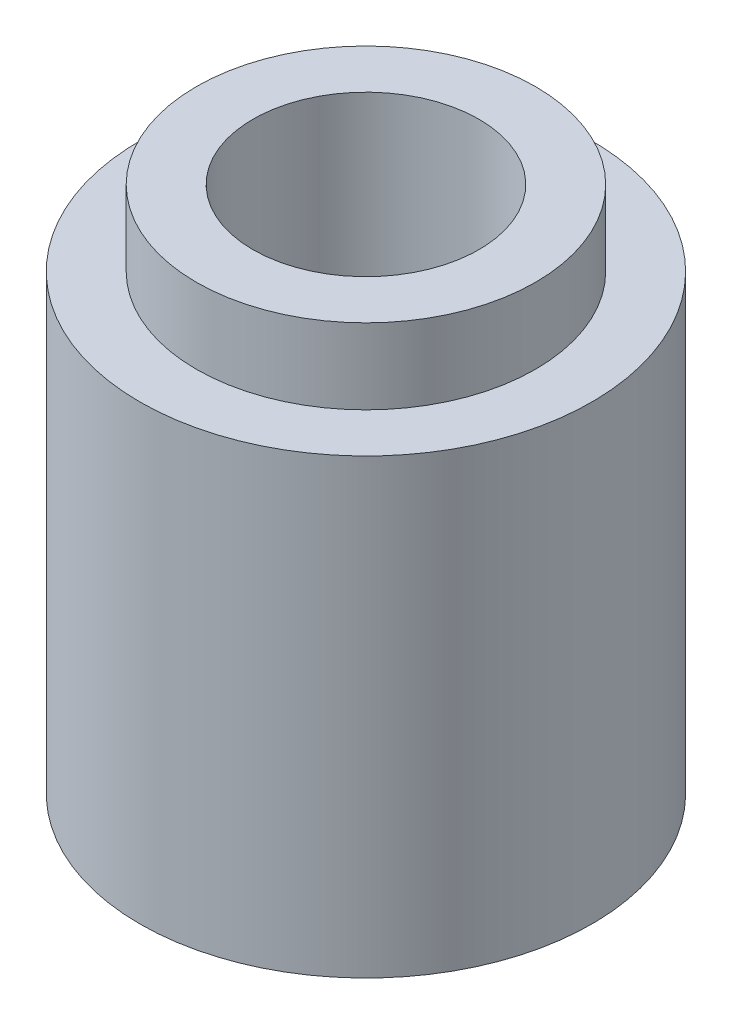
from build123d import *

# Parameters (mm, degrees)
SKETCH_1_R          = 3
EXTRUDE_1_DEPTH     = 6
SKETCH_2_R          = 2.25
EXTRUDE_2_DEPTH     = 1
SKETCH_3_R          = 1.5
CUT_EXTRUDE_1_DEPTH = 7


with BuildPart() as part:
    # Sketch 1 → Extrude 1 (new body)
    with BuildSketch(Plane(origin=(0, 0, 0), x_dir=(1, 0, 0), z_dir=(0, 1, 0))):
        with Locations(Location((0, 0, 0), (0, 0, 270))):
            Circle(SKETCH_1_R)
    extrude(amount=EXTRUDE_1_DEPTH)

    # Sketch 2 → Extrude 2 (add)
    with BuildSketch(Plane(origin=(0, 6, 0), x_dir=(1, 0, 0), z_dir=(0, 1, 0))):
        with Locations(Location((0, 0, 0), (0, 0, 270))):
            Circle(SKETCH_2_R)
    extrude(amount=EXTRUDE_2_DEPTH)

    # Sketch 3 → Cut-Extrude 1 (cut)
    with BuildSketch(Plane.XZ):
        with Locations(Location((0, 0, 0), (0, 0, 270))):
            Circle(SKETCH_3_R)
    extrude(amount=-CUT_EXTRUDE_1_DEPTH, mode=Mode.SUBTRACT)


solid = part.part
